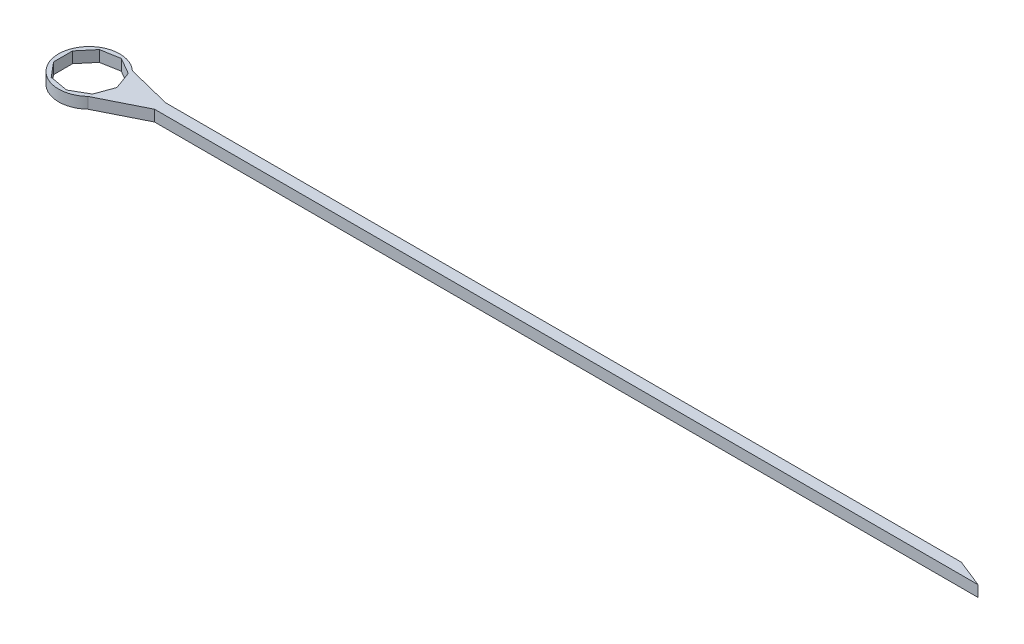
ISO-10303-21;
HEADER;
FILE_DESCRIPTION(('STEP AP214'),'2;1');
FILE_NAME('part.step','',(''),(''),'','','');
FILE_SCHEMA(('AUTOMOTIVE_DESIGN { 1 0 10303 214 1 1 1 1 }'));
ENDSEC;
DATA;
#1=APPLICATION_CONTEXT('core data for automotive mechanical design processes');
#2=APPLICATION_PROTOCOL_DEFINITION('international standard','automotive_design',2000,#1);
#3=PRODUCT_CONTEXT('',#1,'mechanical');
#4=PRODUCT('Part','Part','',(#3));
#5=PRODUCT_RELATED_PRODUCT_CATEGORY('part','',(#4));
#6=PRODUCT_DEFINITION_FORMATION('','',#4);
#7=PRODUCT_DEFINITION_CONTEXT('part definition',#1,'design');
#8=PRODUCT_DEFINITION('design','',#6,#7);
#9=PRODUCT_DEFINITION_SHAPE('','',#8);
#10=(LENGTH_UNIT() NAMED_UNIT(*) SI_UNIT(.MILLI.,.METRE.));
#11=(NAMED_UNIT(*) PLANE_ANGLE_UNIT() SI_UNIT($,.RADIAN.));
#12=(NAMED_UNIT(*) SI_UNIT($,.STERADIAN.) SOLID_ANGLE_UNIT());
#13=UNCERTAINTY_MEASURE_WITH_UNIT(LENGTH_MEASURE(1.E-05),#10,'distance_accuracy_value','');
#14=(GEOMETRIC_REPRESENTATION_CONTEXT(3) GLOBAL_UNCERTAINTY_ASSIGNED_CONTEXT((#13)) GLOBAL_UNIT_ASSIGNED_CONTEXT((#10,
#11,#12)) REPRESENTATION_CONTEXT('',''));
#15=CARTESIAN_POINT('',(0.,0.,0.));
#16=DIRECTION('',(0.,0.,1.));
#17=DIRECTION('',(1.,0.,0.));
#18=AXIS2_PLACEMENT_3D('',#15,#16,#17);
#19=CARTESIAN_POINT('',(0.,1.,0.));
#20=DIRECTION('',(0.,1.,0.));
#21=DIRECTION('',(0.,0.,1.));
#22=AXIS2_PLACEMENT_3D('',#19,#20,#21);
#23=PLANE('',#22);
#24=DIRECTION('',(0.894427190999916,0.,-0.447213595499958));
#25=VECTOR('',#24,1.);
#26=CARTESIAN_POINT('',(5.88745860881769,1.,0.));
#27=LINE('',#26,#25);
#28=CARTESIAN_POINT('',(1.88745860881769,1.,2.));
#29=VERTEX_POINT('',#28);
#30=CARTESIAN_POINT('',(5.88745860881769,1.,0.));
#31=VERTEX_POINT('',#30);
#32=EDGE_CURVE('E211',#29,#31,#27,.T.);
#33=ORIENTED_EDGE('',*,*,#32,.T.);
#34=DIRECTION('',(1.,0.,0.));
#35=VECTOR('',#34,1.);
#36=CARTESIAN_POINT('',(5.88745860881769,1.,0.));
#37=LINE('',#36,#35);
#38=CARTESIAN_POINT('',(80.,1.,0.));
#39=VERTEX_POINT('',#38);
#40=EDGE_CURVE('E214',#31,#39,#37,.T.);
#41=ORIENTED_EDGE('',*,*,#40,.T.);
#42=DIRECTION('',(-0.928476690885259,0.,-0.371390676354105));
#43=VECTOR('',#42,1.);
#44=CARTESIAN_POINT('',(80.,1.,0.));
#45=LINE('',#44,#43);
#46=CARTESIAN_POINT('',(77.5,1.,-1.00000000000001));
#47=VERTEX_POINT('',#46);
#48=EDGE_CURVE('E217',#39,#47,#45,.T.);
#49=ORIENTED_EDGE('',*,*,#48,.T.);
#50=DIRECTION('',(-1.,0.,0.));
#51=VECTOR('',#50,1.);
#52=CARTESIAN_POINT('',(77.5,1.,-1.00000000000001));
#53=LINE('',#52,#51);
#54=CARTESIAN_POINT('',(5.88745860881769,1.,-0.999999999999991));
#55=VERTEX_POINT('',#54);
#56=EDGE_CURVE('E219',#47,#55,#53,.T.);
#57=ORIENTED_EDGE('',*,*,#56,.T.);
#58=DIRECTION('',(-0.970142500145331,0.,-0.242535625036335));
#59=VECTOR('',#58,1.);
#60=CARTESIAN_POINT('',(5.88745860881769,1.,-0.999999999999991));
#61=LINE('',#60,#59);
#62=CARTESIAN_POINT('',(1.88745860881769,1.,-2.));
#63=VERTEX_POINT('',#62);
#64=EDGE_CURVE('E221',#55,#63,#61,.T.);
#65=ORIENTED_EDGE('',*,*,#64,.T.);
#66=CARTESIAN_POINT('',(0.,1.,0.));
#67=DIRECTION('',(0.,1.,0.));
#68=DIRECTION('',(0.,0.,1.));
#69=AXIS2_PLACEMENT_3D('',#66,#67,#68);
#70=CIRCLE('',#69,2.75);
#71=EDGE_CURVE('E223',#63,#29,#70,.T.);
#72=ORIENTED_EDGE('',*,*,#71,.T.);
#73=EDGE_LOOP('',(#33,#41,#49,#57,#65,#72));
#74=FACE_BOUND('',#73,.T.);
#75=DIRECTION('',(-0.342020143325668,0.,-0.939692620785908));
#76=VECTOR('',#75,1.);
#77=CARTESIAN_POINT('',(2.5,1.,0.));
#78=LINE('',#77,#76);
#79=CARTESIAN_POINT('',(2.5,1.,0.));
#80=VERTEX_POINT('',#79);
#81=CARTESIAN_POINT('',(1.91511110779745,1.,-1.60696902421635));
#82=VERTEX_POINT('',#81);
#83=EDGE_CURVE('E147',#80,#82,#78,.T.);
#84=ORIENTED_EDGE('',*,*,#83,.F.);
#85=DIRECTION('',(0.342020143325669,0.,-0.939692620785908));
#86=VECTOR('',#85,1.);
#87=CARTESIAN_POINT('',(1.91511110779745,1.,1.60696902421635));
#88=LINE('',#87,#86);
#89=CARTESIAN_POINT('',(1.91511110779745,1.,1.60696902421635));
#90=VERTEX_POINT('',#89);
#91=EDGE_CURVE('E139',#90,#80,#88,.T.);
#92=ORIENTED_EDGE('',*,*,#91,.F.);
#93=DIRECTION('',(0.866025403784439,0.,-0.5));
#94=VECTOR('',#93,1.);
#95=CARTESIAN_POINT('',(0.434120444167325,1.,2.46201938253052));
#96=LINE('',#95,#94);
#97=CARTESIAN_POINT('',(0.434120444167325,1.,2.46201938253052));
#98=VERTEX_POINT('',#97);
#99=EDGE_CURVE('E174',#98,#90,#96,.T.);
#100=ORIENTED_EDGE('',*,*,#99,.F.);
#101=DIRECTION('',(0.984807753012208,0.,0.17364817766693));
#102=VECTOR('',#101,1.);
#103=CARTESIAN_POINT('',(-1.25,1.,2.1650635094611));
#104=LINE('',#103,#102);
#105=CARTESIAN_POINT('',(-1.25,1.,2.1650635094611));
#106=VERTEX_POINT('',#105);
#107=EDGE_CURVE('E172',#106,#98,#104,.T.);
#108=ORIENTED_EDGE('',*,*,#107,.F.);
#109=DIRECTION('',(0.642787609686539,0.,0.766044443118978));
#110=VECTOR('',#109,1.);
#111=CARTESIAN_POINT('',(-2.34923155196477,1.,0.855050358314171));
#112=LINE('',#111,#110);
#113=CARTESIAN_POINT('',(-2.34923155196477,1.,0.855050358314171));
#114=VERTEX_POINT('',#113);
#115=EDGE_CURVE('E170',#114,#106,#112,.T.);
#116=ORIENTED_EDGE('',*,*,#115,.F.);
#117=DIRECTION('',(0.,0.,1.));
#118=VECTOR('',#117,1.);
#119=CARTESIAN_POINT('',(-2.34923155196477,1.,-0.855050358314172));
#120=LINE('',#119,#118);
#121=CARTESIAN_POINT('',(-2.34923155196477,1.,-0.855050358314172));
#122=VERTEX_POINT('',#121);
#123=EDGE_CURVE('E168',#122,#114,#120,.T.);
#124=ORIENTED_EDGE('',*,*,#123,.F.);
#125=DIRECTION('',(-0.642787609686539,0.,0.766044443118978));
#126=VECTOR('',#125,1.);
#127=CARTESIAN_POINT('',(-1.25,1.,-2.1650635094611));
#128=LINE('',#127,#126);
#129=CARTESIAN_POINT('',(-1.25,1.,-2.1650635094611));
#130=VERTEX_POINT('',#129);
#131=EDGE_CURVE('E166',#130,#122,#128,.T.);
#132=ORIENTED_EDGE('',*,*,#131,.F.);
#133=DIRECTION('',(-0.984807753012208,0.,0.173648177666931));
#134=VECTOR('',#133,1.);
#135=CARTESIAN_POINT('',(0.434120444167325,1.,-2.46201938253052));
#136=LINE('',#135,#134);
#137=CARTESIAN_POINT('',(0.434120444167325,1.,-2.46201938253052));
#138=VERTEX_POINT('',#137);
#139=EDGE_CURVE('E162',#138,#130,#136,.T.);
#140=ORIENTED_EDGE('',*,*,#139,.F.);
#141=DIRECTION('',(-0.866025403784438,0.,-0.5));
#142=VECTOR('',#141,1.);
#143=CARTESIAN_POINT('',(1.91511110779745,1.,-1.60696902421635));
#144=LINE('',#143,#142);
#145=EDGE_CURVE('E160',#82,#138,#144,.T.);
#146=ORIENTED_EDGE('',*,*,#145,.F.);
#147=EDGE_LOOP('',(#84,#92,#100,#108,#116,#124,#132,#140,#146));
#148=FACE_BOUND('',#147,.T.);
#149=ADVANCED_FACE('F32',(#74,#148),#23,.T.);
#150=CARTESIAN_POINT('',(0.,0.,0.));
#151=DIRECTION('',(0.,1.,0.));
#152=DIRECTION('',(0.,0.,1.));
#153=AXIS2_PLACEMENT_3D('',#150,#151,#152);
#154=PLANE('',#153);
#155=DIRECTION('',(0.894427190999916,0.,-0.447213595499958));
#156=VECTOR('',#155,1.);
#157=CARTESIAN_POINT('',(5.88745860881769,0.,0.));
#158=LINE('',#157,#156);
#159=CARTESIAN_POINT('',(1.88745860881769,0.,2.));
#160=VERTEX_POINT('',#159);
#161=CARTESIAN_POINT('',(5.88745860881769,0.,0.));
#162=VERTEX_POINT('',#161);
#163=EDGE_CURVE('E155',#160,#162,#158,.T.);
#164=ORIENTED_EDGE('',*,*,#163,.F.);
#165=CARTESIAN_POINT('',(0.,0.,0.));
#166=DIRECTION('',(0.,1.,0.));
#167=DIRECTION('',(0.,0.,1.));
#168=AXIS2_PLACEMENT_3D('',#165,#166,#167);
#169=CIRCLE('',#168,2.75);
#170=CARTESIAN_POINT('',(1.88745860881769,0.,-2.));
#171=VERTEX_POINT('',#170);
#172=EDGE_CURVE('E215',#171,#160,#169,.T.);
#173=ORIENTED_EDGE('',*,*,#172,.F.);
#174=DIRECTION('',(-0.970142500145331,0.,-0.242535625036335));
#175=VECTOR('',#174,1.);
#176=CARTESIAN_POINT('',(5.88745860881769,0.,-0.999999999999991));
#177=LINE('',#176,#175);
#178=CARTESIAN_POINT('',(5.88745860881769,0.,-0.999999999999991));
#179=VERTEX_POINT('',#178);
#180=EDGE_CURVE('E234',#179,#171,#177,.T.);
#181=ORIENTED_EDGE('',*,*,#180,.F.);
#182=DIRECTION('',(-1.,0.,0.));
#183=VECTOR('',#182,1.);
#184=CARTESIAN_POINT('',(77.5,0.,-1.00000000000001));
#185=LINE('',#184,#183);
#186=CARTESIAN_POINT('',(77.5,0.,-1.00000000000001));
#187=VERTEX_POINT('',#186);
#188=EDGE_CURVE('E232',#187,#179,#185,.T.);
#189=ORIENTED_EDGE('',*,*,#188,.F.);
#190=DIRECTION('',(-0.928476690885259,0.,-0.371390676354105));
#191=VECTOR('',#190,1.);
#192=CARTESIAN_POINT('',(80.,0.,0.));
#193=LINE('',#192,#191);
#194=CARTESIAN_POINT('',(80.,0.,0.));
#195=VERTEX_POINT('',#194);
#196=EDGE_CURVE('E230',#195,#187,#193,.T.);
#197=ORIENTED_EDGE('',*,*,#196,.F.);
#198=DIRECTION('',(1.,0.,0.));
#199=VECTOR('',#198,1.);
#200=CARTESIAN_POINT('',(5.88745860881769,0.,0.));
#201=LINE('',#200,#199);
#202=EDGE_CURVE('E228',#162,#195,#201,.T.);
#203=ORIENTED_EDGE('',*,*,#202,.F.);
#204=EDGE_LOOP('',(#164,#173,#181,#189,#197,#203));
#205=FACE_BOUND('',#204,.T.);
#206=DIRECTION('',(0.342020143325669,0.,-0.939692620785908));
#207=VECTOR('',#206,1.);
#208=CARTESIAN_POINT('',(1.91511110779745,0.,1.60696902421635));
#209=LINE('',#208,#207);
#210=CARTESIAN_POINT('',(1.91511110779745,0.,1.60696902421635));
#211=VERTEX_POINT('',#210);
#212=CARTESIAN_POINT('',(2.5,0.,0.));
#213=VERTEX_POINT('',#212);
#214=EDGE_CURVE('E55',#211,#213,#209,.T.);
#215=ORIENTED_EDGE('',*,*,#214,.T.);
#216=DIRECTION('',(-0.342020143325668,0.,-0.939692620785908));
#217=VECTOR('',#216,1.);
#218=CARTESIAN_POINT('',(2.5,0.,0.));
#219=LINE('',#218,#217);
#220=CARTESIAN_POINT('',(1.91511110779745,0.,-1.60696902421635));
#221=VERTEX_POINT('',#220);
#222=EDGE_CURVE('E154',#213,#221,#219,.T.);
#223=ORIENTED_EDGE('',*,*,#222,.T.);
#224=DIRECTION('',(-0.866025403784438,0.,-0.5));
#225=VECTOR('',#224,1.);
#226=CARTESIAN_POINT('',(1.91511110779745,0.,-1.60696902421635));
#227=LINE('',#226,#225);
#228=CARTESIAN_POINT('',(0.434120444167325,0.,-2.46201938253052));
#229=VERTEX_POINT('',#228);
#230=EDGE_CURVE('E178',#221,#229,#227,.T.);
#231=ORIENTED_EDGE('',*,*,#230,.T.);
#232=DIRECTION('',(-0.984807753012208,0.,0.173648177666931));
#233=VECTOR('',#232,1.);
#234=CARTESIAN_POINT('',(0.434120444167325,0.,-2.46201938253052));
#235=LINE('',#234,#233);
#236=CARTESIAN_POINT('',(-1.25,0.,-2.1650635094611));
#237=VERTEX_POINT('',#236);
#238=EDGE_CURVE('E181',#229,#237,#235,.T.);
#239=ORIENTED_EDGE('',*,*,#238,.T.);
#240=DIRECTION('',(-0.642787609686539,0.,0.766044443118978));
#241=VECTOR('',#240,1.);
#242=CARTESIAN_POINT('',(-1.25,0.,-2.1650635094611));
#243=LINE('',#242,#241);
#244=CARTESIAN_POINT('',(-2.34923155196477,0.,-0.855050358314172));
#245=VERTEX_POINT('',#244);
#246=EDGE_CURVE('E184',#237,#245,#243,.T.);
#247=ORIENTED_EDGE('',*,*,#246,.T.);
#248=DIRECTION('',(0.,0.,1.));
#249=VECTOR('',#248,1.);
#250=CARTESIAN_POINT('',(-2.34923155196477,0.,-0.855050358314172));
#251=LINE('',#250,#249);
#252=CARTESIAN_POINT('',(-2.34923155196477,0.,0.855050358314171));
#253=VERTEX_POINT('',#252);
#254=EDGE_CURVE('E187',#245,#253,#251,.T.);
#255=ORIENTED_EDGE('',*,*,#254,.T.);
#256=DIRECTION('',(0.642787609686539,0.,0.766044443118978));
#257=VECTOR('',#256,1.);
#258=CARTESIAN_POINT('',(-2.34923155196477,0.,0.855050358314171));
#259=LINE('',#258,#257);
#260=CARTESIAN_POINT('',(-1.25,0.,2.1650635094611));
#261=VERTEX_POINT('',#260);
#262=EDGE_CURVE('E190',#253,#261,#259,.T.);
#263=ORIENTED_EDGE('',*,*,#262,.T.);
#264=DIRECTION('',(0.984807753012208,0.,0.17364817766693));
#265=VECTOR('',#264,1.);
#266=CARTESIAN_POINT('',(-1.25,0.,2.1650635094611));
#267=LINE('',#266,#265);
#268=CARTESIAN_POINT('',(0.434120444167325,0.,2.46201938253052));
#269=VERTEX_POINT('',#268);
#270=EDGE_CURVE('E193',#261,#269,#267,.T.);
#271=ORIENTED_EDGE('',*,*,#270,.T.);
#272=DIRECTION('',(0.866025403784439,0.,-0.5));
#273=VECTOR('',#272,1.);
#274=CARTESIAN_POINT('',(0.434120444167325,0.,2.46201938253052));
#275=LINE('',#274,#273);
#276=EDGE_CURVE('E148',#269,#211,#275,.T.);
#277=ORIENTED_EDGE('',*,*,#276,.T.);
#278=EDGE_LOOP('',(#215,#223,#231,#239,#247,#255,#263,#271,#277));
#279=FACE_BOUND('',#278,.T.);
#280=ADVANCED_FACE('F258',(#205,#279),#154,.F.);
#281=CARTESIAN_POINT('',(5.88745860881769,1.,0.));
#282=DIRECTION('',(-0.447213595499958,0.,-0.894427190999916));
#283=DIRECTION('',(-0.894427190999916,0.,0.447213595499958));
#284=AXIS2_PLACEMENT_3D('',#281,#282,#283);
#285=PLANE('',#284);
#286=ORIENTED_EDGE('',*,*,#163,.T.);
#287=DIRECTION('',(0.,-1.,0.));
#288=VECTOR('',#287,1.);
#289=CARTESIAN_POINT('',(5.88745860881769,1.,0.));
#290=LINE('',#289,#288);
#291=EDGE_CURVE('E11',#31,#162,#290,.T.);
#292=ORIENTED_EDGE('',*,*,#291,.F.);
#293=ORIENTED_EDGE('',*,*,#32,.F.);
#294=DIRECTION('',(0.,-1.,0.));
#295=VECTOR('',#294,1.);
#296=CARTESIAN_POINT('',(1.88745860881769,1.,2.));
#297=LINE('',#296,#295);
#298=EDGE_CURVE('E225',#29,#160,#297,.T.);
#299=ORIENTED_EDGE('',*,*,#298,.T.);
#300=EDGE_LOOP('',(#286,#292,#293,#299));
#301=FACE_BOUND('',#300,.T.);
#302=ADVANCED_FACE('F34',(#301),#285,.F.);
#303=CARTESIAN_POINT('',(5.88745860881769,1.,0.));
#304=DIRECTION('',(0.,0.,-1.));
#305=DIRECTION('',(-1.,0.,0.));
#306=AXIS2_PLACEMENT_3D('',#303,#304,#305);
#307=PLANE('',#306);
#308=ORIENTED_EDGE('',*,*,#202,.T.);
#309=DIRECTION('',(0.,-1.,0.));
#310=VECTOR('',#309,1.);
#311=CARTESIAN_POINT('',(80.,1.,0.));
#312=LINE('',#311,#310);
#313=EDGE_CURVE('E40',#39,#195,#312,.T.);
#314=ORIENTED_EDGE('',*,*,#313,.F.);
#315=ORIENTED_EDGE('',*,*,#40,.F.);
#316=ORIENTED_EDGE('',*,*,#291,.T.);
#317=EDGE_LOOP('',(#308,#314,#315,#316));
#318=FACE_BOUND('',#317,.T.);
#319=ADVANCED_FACE('F275',(#318),#307,.F.);
#320=CARTESIAN_POINT('',(80.,1.,0.));
#321=DIRECTION('',(-0.371390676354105,0.,0.928476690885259));
#322=DIRECTION('',(0.928476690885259,0.,0.371390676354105));
#323=AXIS2_PLACEMENT_3D('',#320,#321,#322);
#324=PLANE('',#323);
#325=ORIENTED_EDGE('',*,*,#196,.T.);
#326=DIRECTION('',(0.,-1.,0.));
#327=VECTOR('',#326,1.);
#328=CARTESIAN_POINT('',(77.5,1.,-1.00000000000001));
#329=LINE('',#328,#327);
#330=EDGE_CURVE('E245',#47,#187,#329,.T.);
#331=ORIENTED_EDGE('',*,*,#330,.F.);
#332=ORIENTED_EDGE('',*,*,#48,.F.);
#333=ORIENTED_EDGE('',*,*,#313,.T.);
#334=EDGE_LOOP('',(#325,#331,#332,#333));
#335=FACE_BOUND('',#334,.T.);
#336=ADVANCED_FACE('F252',(#335),#324,.F.);
#337=CARTESIAN_POINT('',(77.5,1.,-1.00000000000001));
#338=DIRECTION('',(0.,0.,1.));
#339=DIRECTION('',(1.,0.,0.));
#340=AXIS2_PLACEMENT_3D('',#337,#338,#339);
#341=PLANE('',#340);
#342=ORIENTED_EDGE('',*,*,#188,.T.);
#343=DIRECTION('',(0.,-1.,0.));
#344=VECTOR('',#343,1.);
#345=CARTESIAN_POINT('',(5.88745860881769,1.,-0.999999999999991));
#346=LINE('',#345,#344);
#347=EDGE_CURVE('E242',#55,#179,#346,.T.);
#348=ORIENTED_EDGE('',*,*,#347,.F.);
#349=ORIENTED_EDGE('',*,*,#56,.F.);
#350=ORIENTED_EDGE('',*,*,#330,.T.);
#351=EDGE_LOOP('',(#342,#348,#349,#350));
#352=FACE_BOUND('',#351,.T.);
#353=ADVANCED_FACE('F264',(#352),#341,.F.);
#354=CARTESIAN_POINT('',(5.88745860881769,1.,-0.999999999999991));
#355=DIRECTION('',(-0.242535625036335,0.,0.970142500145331));
#356=DIRECTION('',(0.970142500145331,0.,0.242535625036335));
#357=AXIS2_PLACEMENT_3D('',#354,#355,#356);
#358=PLANE('',#357);
#359=ORIENTED_EDGE('',*,*,#180,.T.);
#360=DIRECTION('',(0.,-1.,0.));
#361=VECTOR('',#360,1.);
#362=CARTESIAN_POINT('',(1.88745860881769,1.,-2.));
#363=LINE('',#362,#361);
#364=EDGE_CURVE('E239',#63,#171,#363,.T.);
#365=ORIENTED_EDGE('',*,*,#364,.F.);
#366=ORIENTED_EDGE('',*,*,#64,.F.);
#367=ORIENTED_EDGE('',*,*,#347,.T.);
#368=EDGE_LOOP('',(#359,#365,#366,#367));
#369=FACE_BOUND('',#368,.T.);
#370=ADVANCED_FACE('F268',(#369),#358,.F.);
#371=CARTESIAN_POINT('',(0.,1.,0.));
#372=DIRECTION('',(0.,-1.,0.));
#373=DIRECTION('',(0.,0.,-1.));
#374=AXIS2_PLACEMENT_3D('',#371,#372,#373);
#375=CYLINDRICAL_SURFACE('',#374,2.75);
#376=ORIENTED_EDGE('',*,*,#172,.T.);
#377=ORIENTED_EDGE('',*,*,#298,.F.);
#378=ORIENTED_EDGE('',*,*,#71,.F.);
#379=ORIENTED_EDGE('',*,*,#364,.T.);
#380=EDGE_LOOP('',(#376,#377,#378,#379));
#381=FACE_BOUND('',#380,.T.);
#382=ADVANCED_FACE('F278',(#381),#375,.T.);
#383=CARTESIAN_POINT('',(1.91511110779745,1.,1.60696902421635));
#384=DIRECTION('',(-0.939692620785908,0.,-0.342020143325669));
#385=DIRECTION('',(-0.342020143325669,0.,0.939692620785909));
#386=AXIS2_PLACEMENT_3D('',#383,#384,#385);
#387=PLANE('',#386);
#388=ORIENTED_EDGE('',*,*,#214,.F.);
#389=DIRECTION('',(0.,-1.,0.));
#390=VECTOR('',#389,1.);
#391=CARTESIAN_POINT('',(1.91511110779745,1.,1.60696902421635));
#392=LINE('',#391,#390);
#393=EDGE_CURVE('E143',#90,#211,#392,.T.);
#394=ORIENTED_EDGE('',*,*,#393,.F.);
#395=ORIENTED_EDGE('',*,*,#91,.T.);
#396=DIRECTION('',(0.,-1.,0.));
#397=VECTOR('',#396,1.);
#398=CARTESIAN_POINT('',(2.5,1.,0.));
#399=LINE('',#398,#397);
#400=EDGE_CURVE('E142',#80,#213,#399,.T.);
#401=ORIENTED_EDGE('',*,*,#400,.T.);
#402=EDGE_LOOP('',(#388,#394,#395,#401));
#403=FACE_BOUND('',#402,.T.);
#404=ADVANCED_FACE('F141',(#403),#387,.T.);
#405=CARTESIAN_POINT('',(2.5,1.,0.));
#406=DIRECTION('',(-0.939692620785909,0.,0.342020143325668));
#407=DIRECTION('',(0.342020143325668,0.,0.939692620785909));
#408=AXIS2_PLACEMENT_3D('',#405,#406,#407);
#409=PLANE('',#408);
#410=ORIENTED_EDGE('',*,*,#222,.F.);
#411=ORIENTED_EDGE('',*,*,#400,.F.);
#412=ORIENTED_EDGE('',*,*,#83,.T.);
#413=DIRECTION('',(0.,-1.,0.));
#414=VECTOR('',#413,1.);
#415=CARTESIAN_POINT('',(1.91511110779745,1.,-1.60696902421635));
#416=LINE('',#415,#414);
#417=EDGE_CURVE('E156',#82,#221,#416,.T.);
#418=ORIENTED_EDGE('',*,*,#417,.T.);
#419=EDGE_LOOP('',(#410,#411,#412,#418));
#420=FACE_BOUND('',#419,.T.);
#421=ADVANCED_FACE('F151',(#420),#409,.T.);
#422=CARTESIAN_POINT('',(1.91511110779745,1.,-1.60696902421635));
#423=DIRECTION('',(-0.5,0.,0.866025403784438));
#424=DIRECTION('',(0.866025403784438,0.,0.5));
#425=AXIS2_PLACEMENT_3D('',#422,#423,#424);
#426=PLANE('',#425);
#427=ORIENTED_EDGE('',*,*,#230,.F.);
#428=ORIENTED_EDGE('',*,*,#417,.F.);
#429=ORIENTED_EDGE('',*,*,#145,.T.);
#430=DIRECTION('',(0.,-1.,0.));
#431=VECTOR('',#430,1.);
#432=CARTESIAN_POINT('',(0.434120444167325,1.,-2.46201938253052));
#433=LINE('',#432,#431);
#434=EDGE_CURVE('E208',#138,#229,#433,.T.);
#435=ORIENTED_EDGE('',*,*,#434,.T.);
#436=EDGE_LOOP('',(#427,#428,#429,#435));
#437=FACE_BOUND('',#436,.T.);
#438=ADVANCED_FACE('F296',(#437),#426,.T.);
#439=CARTESIAN_POINT('',(0.434120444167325,1.,-2.46201938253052));
#440=DIRECTION('',(0.173648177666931,0.,0.984807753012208));
#441=DIRECTION('',(0.984807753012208,0.,-0.173648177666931));
#442=AXIS2_PLACEMENT_3D('',#439,#440,#441);
#443=PLANE('',#442);
#444=ORIENTED_EDGE('',*,*,#238,.F.);
#445=ORIENTED_EDGE('',*,*,#434,.F.);
#446=ORIENTED_EDGE('',*,*,#139,.T.);
#447=DIRECTION('',(0.,-1.,0.));
#448=VECTOR('',#447,1.);
#449=CARTESIAN_POINT('',(-1.25,1.,-2.1650635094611));
#450=LINE('',#449,#448);
#451=EDGE_CURVE('E206',#130,#237,#450,.T.);
#452=ORIENTED_EDGE('',*,*,#451,.T.);
#453=EDGE_LOOP('',(#444,#445,#446,#452));
#454=FACE_BOUND('',#453,.T.);
#455=ADVANCED_FACE('F299',(#454),#443,.T.);
#456=CARTESIAN_POINT('',(-1.25,1.,-2.1650635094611));
#457=DIRECTION('',(0.766044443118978,0.,0.642787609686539));
#458=DIRECTION('',(0.642787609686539,0.,-0.766044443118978));
#459=AXIS2_PLACEMENT_3D('',#456,#457,#458);
#460=PLANE('',#459);
#461=ORIENTED_EDGE('',*,*,#246,.F.);
#462=ORIENTED_EDGE('',*,*,#451,.F.);
#463=ORIENTED_EDGE('',*,*,#131,.T.);
#464=DIRECTION('',(0.,-1.,0.));
#465=VECTOR('',#464,1.);
#466=CARTESIAN_POINT('',(-2.34923155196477,1.,-0.855050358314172));
#467=LINE('',#466,#465);
#468=EDGE_CURVE('E204',#122,#245,#467,.T.);
#469=ORIENTED_EDGE('',*,*,#468,.T.);
#470=EDGE_LOOP('',(#461,#462,#463,#469));
#471=FACE_BOUND('',#470,.T.);
#472=ADVANCED_FACE('F303',(#471),#460,.T.);
#473=CARTESIAN_POINT('',(-2.34923155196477,1.,-0.855050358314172));
#474=DIRECTION('',(1.,0.,0.));
#475=DIRECTION('',(0.,0.,-1.));
#476=AXIS2_PLACEMENT_3D('',#473,#474,#475);
#477=PLANE('',#476);
#478=ORIENTED_EDGE('',*,*,#254,.F.);
#479=ORIENTED_EDGE('',*,*,#468,.F.);
#480=ORIENTED_EDGE('',*,*,#123,.T.);
#481=DIRECTION('',(0.,-1.,0.));
#482=VECTOR('',#481,1.);
#483=CARTESIAN_POINT('',(-2.34923155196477,1.,0.855050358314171));
#484=LINE('',#483,#482);
#485=EDGE_CURVE('E202',#114,#253,#484,.T.);
#486=ORIENTED_EDGE('',*,*,#485,.T.);
#487=EDGE_LOOP('',(#478,#479,#480,#486));
#488=FACE_BOUND('',#487,.T.);
#489=ADVANCED_FACE('F307',(#488),#477,.T.);
#490=CARTESIAN_POINT('',(-2.34923155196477,1.,0.855050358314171));
#491=DIRECTION('',(0.766044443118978,0.,-0.642787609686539));
#492=DIRECTION('',(-0.642787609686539,0.,-0.766044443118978));
#493=AXIS2_PLACEMENT_3D('',#490,#491,#492);
#494=PLANE('',#493);
#495=ORIENTED_EDGE('',*,*,#262,.F.);
#496=ORIENTED_EDGE('',*,*,#485,.F.);
#497=ORIENTED_EDGE('',*,*,#115,.T.);
#498=DIRECTION('',(0.,-1.,0.));
#499=VECTOR('',#498,1.);
#500=CARTESIAN_POINT('',(-1.25,1.,2.1650635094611));
#501=LINE('',#500,#499);
#502=EDGE_CURVE('E200',#106,#261,#501,.T.);
#503=ORIENTED_EDGE('',*,*,#502,.T.);
#504=EDGE_LOOP('',(#495,#496,#497,#503));
#505=FACE_BOUND('',#504,.T.);
#506=ADVANCED_FACE('F311',(#505),#494,.T.);
#507=CARTESIAN_POINT('',(-1.25,1.,2.1650635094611));
#508=DIRECTION('',(0.17364817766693,0.,-0.984807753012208));
#509=DIRECTION('',(-0.984807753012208,0.,-0.17364817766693));
#510=AXIS2_PLACEMENT_3D('',#507,#508,#509);
#511=PLANE('',#510);
#512=ORIENTED_EDGE('',*,*,#270,.F.);
#513=ORIENTED_EDGE('',*,*,#502,.F.);
#514=ORIENTED_EDGE('',*,*,#107,.T.);
#515=DIRECTION('',(0.,-1.,0.));
#516=VECTOR('',#515,1.);
#517=CARTESIAN_POINT('',(0.434120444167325,1.,2.46201938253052));
#518=LINE('',#517,#516);
#519=EDGE_CURVE('E47',#98,#269,#518,.T.);
#520=ORIENTED_EDGE('',*,*,#519,.T.);
#521=EDGE_LOOP('',(#512,#513,#514,#520));
#522=FACE_BOUND('',#521,.T.);
#523=ADVANCED_FACE('F315',(#522),#511,.T.);
#524=CARTESIAN_POINT('',(0.434120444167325,1.,2.46201938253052));
#525=DIRECTION('',(-0.5,0.,-0.866025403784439));
#526=DIRECTION('',(-0.866025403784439,0.,0.5));
#527=AXIS2_PLACEMENT_3D('',#524,#525,#526);
#528=PLANE('',#527);
#529=ORIENTED_EDGE('',*,*,#276,.F.);
#530=ORIENTED_EDGE('',*,*,#519,.F.);
#531=ORIENTED_EDGE('',*,*,#99,.T.);
#532=ORIENTED_EDGE('',*,*,#393,.T.);
#533=EDGE_LOOP('',(#529,#530,#531,#532));
#534=FACE_BOUND('',#533,.T.);
#535=ADVANCED_FACE('F319',(#534),#528,.T.);
#536=CLOSED_SHELL('',(#149,#280,#302,#319,#336,#353,#370,#382,#404,#421,#438,#455,#472,#489,
#506,#523,#535));
#537=MANIFOLD_SOLID_BREP('B2',#536);
#538=ADVANCED_BREP_SHAPE_REPRESENTATION('',(#18,#537),#14);
#539=SHAPE_DEFINITION_REPRESENTATION(#9,#538);
ENDSEC;
END-ISO-10303-21;
